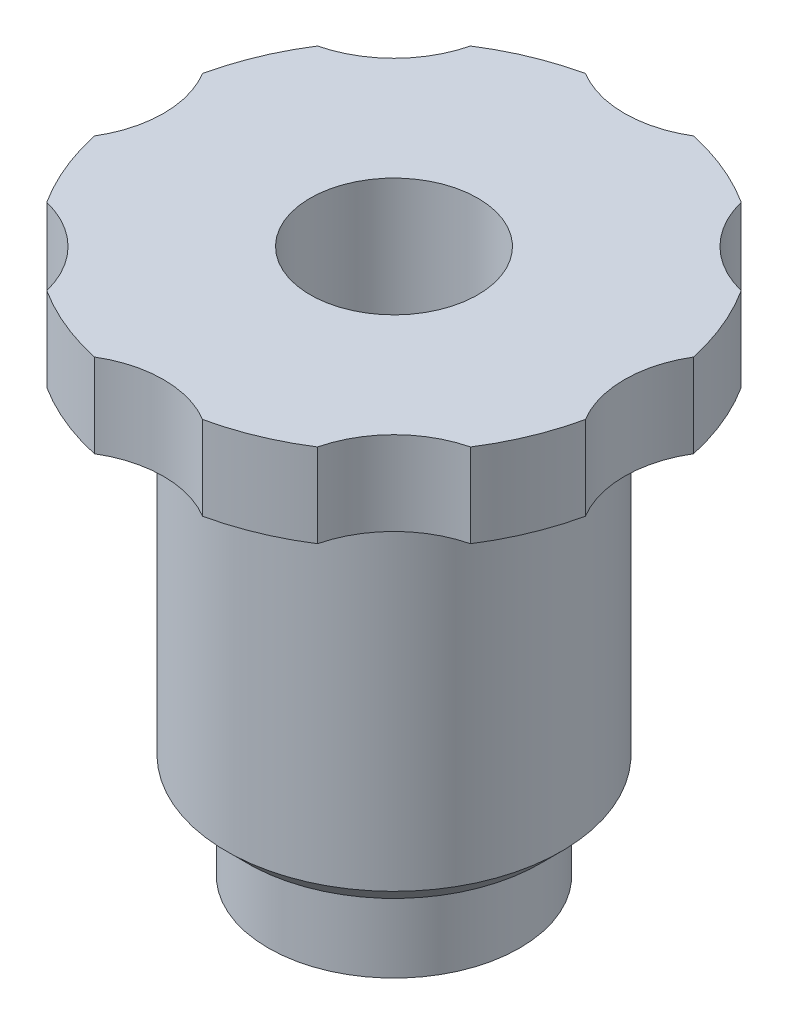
from build123d import *

# Parameters (mm, degrees)
ESQUISSE2_R                  = 2
ENL_V_MAT_EXTRU_1_DEPTH      = 16.524174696
CHANFREIN1_SIZE              = 0.5
ESQUISSE3_R                  = 2.5
ENL_V_MAT_EXTRU_2_DEPTH      = 16.524174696
R_P_TITION_CIRCULAIRE1_COUNT = 8


with BuildPart() as part:
    # Esquisse1 → R_volution1 (revolve)
    with BuildSketch(Plane.XY, mode=Mode.PRIVATE) as r_volution1_sk:
        Polygon((0, 0), (3, 0), (3, 2), (4, 2), (4, 10), (3.5, 10), (3.5, 11), (6, 11), (6, 13), (0, 13), align=None)
    revolve(r_volution1_sk.sketch.rotate(Axis((0, 0, 0), (0, 1, 0)), 90), axis=Axis((0, 0, 0), (0, 1, 0)))

    # Esquisse2 → Enl_v. mat.-Extru.1 (cut, through all)
    with BuildSketch(Plane.XZ):
        with Locations(Location((0, 0, 0), (0, 0, 270))):
            Circle(ESQUISSE2_R)
    extrude(amount=-ENL_V_MAT_EXTRU_1_DEPTH, mode=Mode.SUBTRACT)

    # Chanfrein1
    chanfrein1_edges = [part.edges().sort_by_distance(p)[0] for p in [
        (0, 2, 4),
    ]]
    chamfer(chanfrein1_edges, length=CHANFREIN1_SIZE)

    # Esquisse3 → Enl_v. mat.-Extru.2 (cut, through all)
    with BuildSketch(Plane(origin=(0, 13, 0), x_dir=(-1, 0, 0), z_dir=(0, 1, 0))):
        with Locations((-8, 0)):
            Circle(ESQUISSE3_R)
    enl_v_mat_extru_2 = extrude(amount=-ENL_V_MAT_EXTRU_2_DEPTH, mode=Mode.SUBTRACT)

    # R_p_tition circulaire1: Enl_v. mat.-Extru.2 ×8 about axis
    r_p_tition_circulaire1_axis = Axis((0, 0, 0), (0, 1, 0))
    for i in range(1, R_P_TITION_CIRCULAIRE1_COUNT):
        add(enl_v_mat_extru_2.rotate(r_p_tition_circulaire1_axis, i * 360 / R_P_TITION_CIRCULAIRE1_COUNT), mode=Mode.SUBTRACT)


solid = part.part
